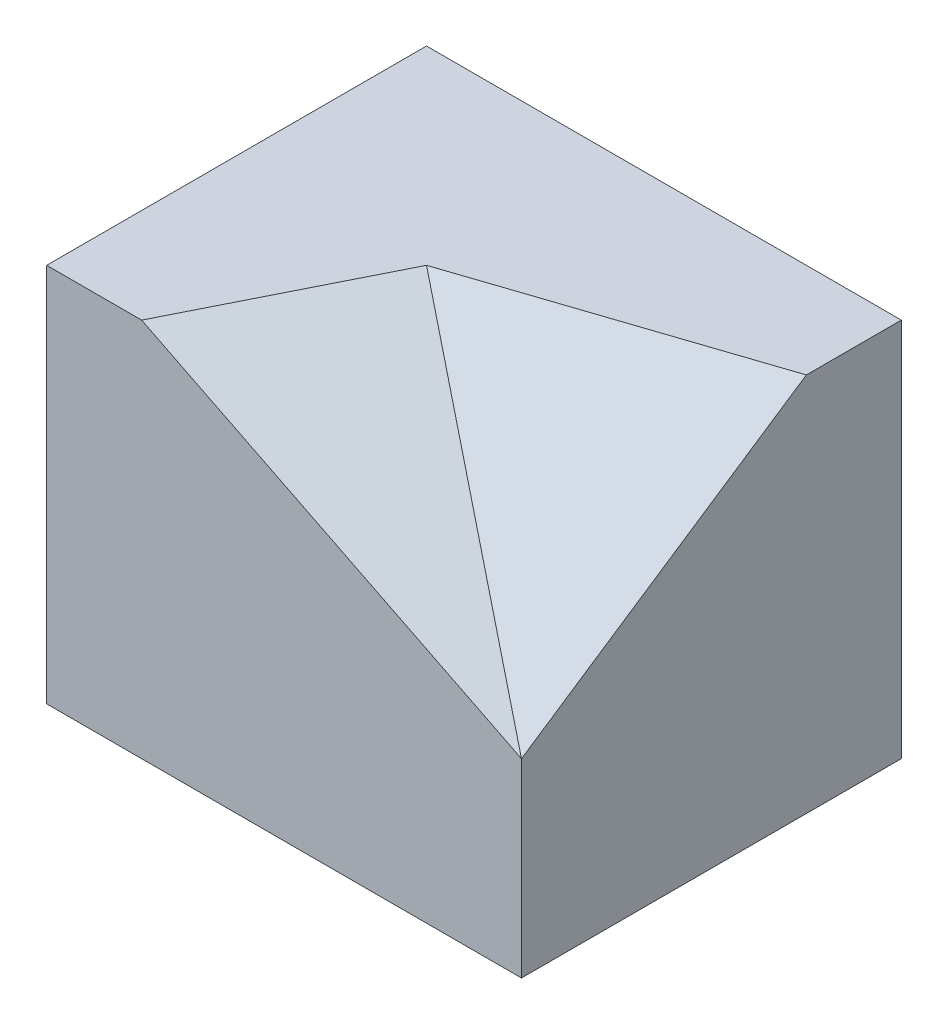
from build123d import *

# Parameters (mm, degrees)
SKETCH1_W      = 50
SKETCH1_H      = 40
EXTRUDE1_DEPTH = 20


with BuildPart() as part:
    # Sketch1 → Extrude1 (new, symmetric)
    with BuildSketch(Plane(origin=(0, 0, 0), x_dir=(1, 0, 0), z_dir=(0, 1, 0))):
        Rectangle(SKETCH1_W, SKETCH1_H)
    extrude(amount=EXTRUDE1_DEPTH, both=True)

    # Sketch2 → Cut-Loft1 section 0
    with BuildSketch(Plane(origin=(0, 20, 0), x_dir=(1, 0, 0), z_dir=(0, 1, 0)), mode=Mode.PRIVATE) as cut_loft1_s0:
        with BuildLine():
            Line((-15, -20), (-5, 0))
            Line((-5, 0), (25, 10))
            Line((25, 10), (25, -20))
            Line((25, -20), (-15, -20))
        make_face()
    loft([cut_loft1_s0.sketch, Vertex(25, 0, 20)], mode=Mode.SUBTRACT)


solid = part.part
